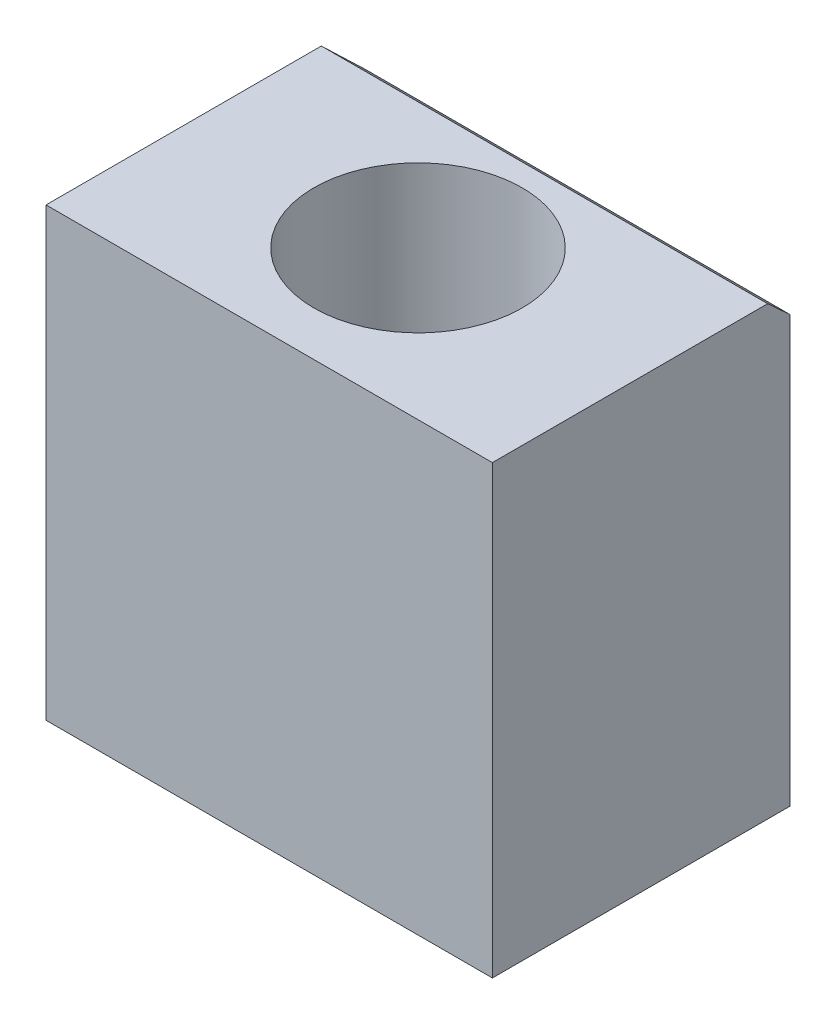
from build123d import *

# Parameters (mm, degrees)
ESQUISSE2_W             = 30
ESQUISSE2_H             = 30
EXTRUSION1_DEPTH        = 20
TROU_TARAUD_M161_D      = 14
TROU_TARAUD_M161_DEPTH  = 38
TROU_TARAUD_M161_TIP    = 4.206024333
ENL_V_MAT_EXTRU_1_DEPTH = 30
ENL_V_MAT_EXTRU_2_DEPTH = 30


with BuildPart() as part:
    # Esquisse2 → Extrusion1 (new body)
    with BuildSketch(Plane.XY):
        with Locations((15, -15)):
            Rectangle(ESQUISSE2_W, ESQUISSE2_H)
    extrude(amount=EXTRUSION1_DEPTH)

    # Trou taraud_ M161
    with Locations(Plane(origin=(0, 0, 0), x_dir=(-1, 0, 0), z_dir=(0, 1, 0))):
        with Locations((-15, 10)):
            Hole(TROU_TARAUD_M161_D / 2, depth=TROU_TARAUD_M161_DEPTH)
            with Locations((0, 0, -(TROU_TARAUD_M161_DEPTH + TROU_TARAUD_M161_TIP / 2))):  # 118° drill point
                Cone(0, TROU_TARAUD_M161_D / 2, TROU_TARAUD_M161_TIP, mode=Mode.SUBTRACT)

    # Esquisse5 → Enl_v. mat.-Extru.1 (cut)
    with BuildSketch(Plane(origin=(30, 0, 0), x_dir=(0, 0, -1), z_dir=(1, 0, 0))):
        Polygon((0, 0), (-1.5, 0), (0, -1.377434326), align=None)
    extrude(amount=-ENL_V_MAT_EXTRU_1_DEPTH, mode=Mode.SUBTRACT)

    # Esquisse9 → Enl_v. mat.-Extru.2 (cut)
    with BuildSketch(Plane(origin=(0, 0, 0), x_dir=(1, 0, 0), z_dir=(0, 1, 0))):
        Polygon((0, -1.5), (1.5, 0), (0, 0), align=None)
    extrude(amount=-ENL_V_MAT_EXTRU_2_DEPTH, mode=Mode.SUBTRACT)


solid = part.part
